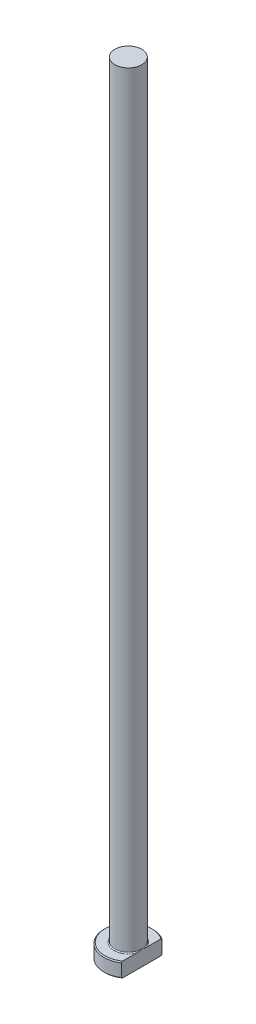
ISO-10303-21;
HEADER;
FILE_DESCRIPTION(('STEP AP214'),'2;1');
FILE_NAME('part.step','',(''),(''),'','','');
FILE_SCHEMA(('AUTOMOTIVE_DESIGN { 1 0 10303 214 1 1 1 1 }'));
ENDSEC;
DATA;
#1=APPLICATION_CONTEXT('core data for automotive mechanical design processes');
#2=APPLICATION_PROTOCOL_DEFINITION('international standard','automotive_design',2000,#1);
#3=PRODUCT_CONTEXT('',#1,'mechanical');
#4=PRODUCT('Part','Part','',(#3));
#5=PRODUCT_RELATED_PRODUCT_CATEGORY('part','',(#4));
#6=PRODUCT_DEFINITION_FORMATION('','',#4);
#7=PRODUCT_DEFINITION_CONTEXT('part definition',#1,'design');
#8=PRODUCT_DEFINITION('design','',#6,#7);
#9=PRODUCT_DEFINITION_SHAPE('','',#8);
#10=(LENGTH_UNIT() NAMED_UNIT(*) SI_UNIT(.MILLI.,.METRE.));
#11=(NAMED_UNIT(*) PLANE_ANGLE_UNIT() SI_UNIT($,.RADIAN.));
#12=(NAMED_UNIT(*) SI_UNIT($,.STERADIAN.) SOLID_ANGLE_UNIT());
#13=UNCERTAINTY_MEASURE_WITH_UNIT(LENGTH_MEASURE(1.E-05),#10,'distance_accuracy_value','');
#14=(GEOMETRIC_REPRESENTATION_CONTEXT(3) GLOBAL_UNCERTAINTY_ASSIGNED_CONTEXT((#13)) GLOBAL_UNIT_ASSIGNED_CONTEXT((#10,
#11,#12)) REPRESENTATION_CONTEXT('',''));
#15=CARTESIAN_POINT('',(0.,0.,0.));
#16=DIRECTION('',(0.,0.,1.));
#17=DIRECTION('',(1.,0.,0.));
#18=AXIS2_PLACEMENT_3D('',#15,#16,#17);
#19=CARTESIAN_POINT('',(0.,0.,0.));
#20=DIRECTION('',(0.,-1.,0.));
#21=DIRECTION('',(0.,0.,-1.));
#22=AXIS2_PLACEMENT_3D('',#19,#20,#21);
#23=PLANE('',#22);
#24=CARTESIAN_POINT('',(0.,0.,0.));
#25=DIRECTION('',(0.,-1.,0.));
#26=DIRECTION('',(0.,0.,-1.));
#27=AXIS2_PLACEMENT_3D('',#24,#25,#26);
#28=CIRCLE('',#27,4.79999999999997);
#29=CARTESIAN_POINT('',(2.74999999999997,0.,3.93414539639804));
#30=VERTEX_POINT('',#29);
#31=CARTESIAN_POINT('',(2.74999999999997,0.,-3.93414539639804));
#32=VERTEX_POINT('',#31);
#33=EDGE_CURVE('E98',#30,#32,#28,.T.);
#34=ORIENTED_EDGE('',*,*,#33,.T.);
#35=DIRECTION('',(0.,0.,1.));
#36=VECTOR('',#35,1.);
#37=CARTESIAN_POINT('',(2.74999999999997,0.,-4.1758232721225));
#38=LINE('',#37,#36);
#39=EDGE_CURVE('E83',#32,#30,#38,.T.);
#40=ORIENTED_EDGE('',*,*,#39,.T.);
#41=EDGE_LOOP('',(#34,#40));
#42=FACE_BOUND('',#41,.T.);
#43=ADVANCED_FACE('F32',(#42),#23,.T.);
#44=CARTESIAN_POINT('',(0.,259.958771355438,0.));
#45=DIRECTION('',(0.,1.,0.));
#46=DIRECTION('',(0.,0.,1.));
#47=AXIS2_PLACEMENT_3D('',#44,#45,#46);
#48=CYLINDRICAL_SURFACE('',#47,4.99999999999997);
#49=CARTESIAN_POINT('',(0.,2.80000000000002,0.));
#50=DIRECTION('',(0.,1.,0.));
#51=DIRECTION('',(0.,0.,1.));
#52=AXIS2_PLACEMENT_3D('',#49,#50,#51);
#53=CIRCLE('',#52,4.99999999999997);
#54=CARTESIAN_POINT('',(2.74999999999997,2.80000000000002,4.1758232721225));
#55=VERTEX_POINT('',#54);
#56=CARTESIAN_POINT('',(2.74999999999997,2.80000000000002,-4.1758232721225));
#57=VERTEX_POINT('',#56);
#58=EDGE_CURVE('E104',#55,#57,#53,.F.);
#59=ORIENTED_EDGE('',*,*,#58,.T.);
#60=DIRECTION('',(0.,-1.,0.));
#61=VECTOR('',#60,1.);
#62=CARTESIAN_POINT('',(2.74999999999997,160.,-4.1758232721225));
#63=LINE('',#62,#61);
#64=CARTESIAN_POINT('',(2.74999999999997,0.199999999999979,-4.1758232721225));
#65=VERTEX_POINT('',#64);
#66=EDGE_CURVE('E183',#57,#65,#63,.T.);
#67=ORIENTED_EDGE('',*,*,#66,.T.);
#68=CARTESIAN_POINT('',(0.,0.199999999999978,0.));
#69=DIRECTION('',(0.,-1.,0.));
#70=DIRECTION('',(0.,0.,-1.));
#71=AXIS2_PLACEMENT_3D('',#68,#69,#70);
#72=CIRCLE('',#71,4.99999999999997);
#73=CARTESIAN_POINT('',(2.74999999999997,0.199999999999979,4.1758232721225));
#74=VERTEX_POINT('',#73);
#75=EDGE_CURVE('E100',#65,#74,#72,.F.);
#76=ORIENTED_EDGE('',*,*,#75,.T.);
#77=DIRECTION('',(0.,-1.,0.));
#78=VECTOR('',#77,1.);
#79=CARTESIAN_POINT('',(2.74999999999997,160.,4.1758232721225));
#80=LINE('',#79,#78);
#81=EDGE_CURVE('E93',#55,#74,#80,.T.);
#82=ORIENTED_EDGE('',*,*,#81,.F.);
#83=EDGE_LOOP('',(#59,#67,#76,#82));
#84=FACE_BOUND('',#83,.T.);
#85=ADVANCED_FACE('F158',(#84),#48,.T.);
#86=CARTESIAN_POINT('',(-4.99999999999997,3.,0.));
#87=DIRECTION('',(0.,1.,0.));
#88=DIRECTION('',(0.,0.,1.));
#89=AXIS2_PLACEMENT_3D('',#86,#87,#88);
#90=PLANE('',#89);
#91=CARTESIAN_POINT('',(0.,3.,0.));
#92=DIRECTION('',(0.,1.,0.));
#93=DIRECTION('',(0.,0.,1.));
#94=AXIS2_PLACEMENT_3D('',#91,#92,#93);
#95=CIRCLE('',#94,4.80000000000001);
#96=CARTESIAN_POINT('',(2.74999999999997,3.,-3.93414539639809));
#97=VERTEX_POINT('',#96);
#98=CARTESIAN_POINT('',(2.74999999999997,3.,3.93414539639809));
#99=VERTEX_POINT('',#98);
#100=EDGE_CURVE('E178',#97,#99,#95,.T.);
#101=ORIENTED_EDGE('',*,*,#100,.T.);
#102=DIRECTION('',(0.,0.,-1.));
#103=VECTOR('',#102,1.);
#104=CARTESIAN_POINT('',(2.74999999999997,3.,0.));
#105=LINE('',#104,#103);
#106=CARTESIAN_POINT('',(2.74999999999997,2.99999999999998,1.06770782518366));
#107=VERTEX_POINT('',#106);
#108=EDGE_CURVE('E57',#99,#107,#105,.T.);
#109=ORIENTED_EDGE('',*,*,#108,.T.);
#110=CARTESIAN_POINT('',(0.,3.,0.));
#111=DIRECTION('',(0.,1.,0.));
#112=DIRECTION('',(0.,0.,1.));
#113=AXIS2_PLACEMENT_3D('',#110,#111,#112);
#114=CIRCLE('',#113,2.94999999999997);
#115=CARTESIAN_POINT('',(2.74999999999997,2.99999999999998,-1.06770782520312));
#116=VERTEX_POINT('',#115);
#117=EDGE_CURVE('E107',#107,#116,#114,.F.);
#118=ORIENTED_EDGE('',*,*,#117,.T.);
#119=EDGE_CURVE('E136',#116,#97,#105,.T.);
#120=ORIENTED_EDGE('',*,*,#119,.T.);
#121=EDGE_LOOP('',(#101,#109,#118,#120));
#122=FACE_BOUND('',#121,.T.);
#123=ADVANCED_FACE('F147',(#122),#90,.T.);
#124=CARTESIAN_POINT('',(0.,3.,0.));
#125=DIRECTION('',(0.,-1.,0.));
#126=DIRECTION('',(0.,0.,-1.));
#127=AXIS2_PLACEMENT_3D('',#124,#125,#126);
#128=CONICAL_SURFACE('',#127,4.80000000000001,0.785398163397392);
#129=ORIENTED_EDGE('',*,*,#58,.F.);
#130=CARTESIAN_POINT('',(2.74999999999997,-1.79114558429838,9.18844783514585));
#131=CARTESIAN_POINT('',(2.74999999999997,-1.62476324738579,9.01476898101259));
#132=CARTESIAN_POINT('',(2.74999999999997,-1.45857819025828,8.84090089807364));
#133=CARTESIAN_POINT('',(2.74999999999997,-1.12668775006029,8.49270511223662));
#134=CARTESIAN_POINT('',(2.74999999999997,-0.960982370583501,8.31837740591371));
#135=CARTESIAN_POINT('',(2.74999999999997,-0.464632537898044,7.79449769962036));
#136=CARTESIAN_POINT('',(2.74999999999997,-0.134839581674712,7.44413786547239));
#137=CARTESIAN_POINT('',(2.74999999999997,0.521406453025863,6.74030951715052));
#138=CARTESIAN_POINT('',(2.74999999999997,0.847859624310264,6.38684108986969));
#139=CARTESIAN_POINT('',(2.74999999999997,1.33353933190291,5.85303151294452));
#140=CARTESIAN_POINT('',(2.74999999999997,1.49475728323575,5.67450358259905));
#141=CARTESIAN_POINT('',(2.74999999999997,1.81545552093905,5.31589537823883));
#142=CARTESIAN_POINT('',(2.74999999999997,1.9749358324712,5.13581512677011));
#143=CARTESIAN_POINT('',(2.74999999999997,2.28246157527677,4.7840971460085));
#144=CARTESIAN_POINT('',(2.74999999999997,2.43063567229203,4.61257212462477));
#145=CARTESIAN_POINT('',(2.74999999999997,2.72427023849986,4.26717959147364));
#146=CARTESIAN_POINT('',(2.74999999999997,2.86973045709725,4.09331186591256));
#147=CARTESIAN_POINT('',(2.74999999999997,3.15716227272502,3.74214491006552));
#148=CARTESIAN_POINT('',(2.74999999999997,3.29912659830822,3.56483970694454));
#149=CARTESIAN_POINT('',(2.74999999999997,3.577639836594,3.20603939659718));
#150=CARTESIAN_POINT('',(2.74999999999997,3.71418980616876,3.02454511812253));
#151=CARTESIAN_POINT('',(2.74999999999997,3.93857405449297,2.71219163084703));
#152=CARTESIAN_POINT('',(2.74999999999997,4.02851673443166,2.58285434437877));
#153=CARTESIAN_POINT('',(2.74999999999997,4.20308451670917,2.32054245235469));
#154=CARTESIAN_POINT('',(2.74999999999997,4.28770764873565,2.18756652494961));
#155=CARTESIAN_POINT('',(2.74999999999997,4.44931959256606,1.91735675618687));
#156=CARTESIAN_POINT('',(2.74999999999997,4.52632375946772,1.78013224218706));
#157=CARTESIAN_POINT('',(2.74999999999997,4.66966790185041,1.50031327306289));
#158=CARTESIAN_POINT('',(2.74999999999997,4.73601725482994,1.35772367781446));
#159=CARTESIAN_POINT('',(2.74999999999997,4.86065113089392,1.04856386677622));
#160=CARTESIAN_POINT('',(2.74999999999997,4.91700799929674,0.881171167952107));
#161=CARTESIAN_POINT('',(2.74999999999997,4.98102802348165,0.625229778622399));
#162=CARTESIAN_POINT('',(2.74999999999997,4.99893817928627,0.539229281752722));
#163=CARTESIAN_POINT('',(2.74999999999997,5.02707157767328,0.365959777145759));
#164=CARTESIAN_POINT('',(2.74999999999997,5.03729562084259,0.278690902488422));
#165=CARTESIAN_POINT('',(2.74999999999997,5.04949232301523,0.102763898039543));
#166=CARTESIAN_POINT('',(2.74999999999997,5.0513883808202,0.0141003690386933));
#167=CARTESIAN_POINT('',(2.74999999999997,5.04659669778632,-0.162990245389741));
#168=CARTESIAN_POINT('',(2.74999999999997,5.03990892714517,-0.251417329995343));
#169=CARTESIAN_POINT('',(2.74999999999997,5.01835539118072,-0.427430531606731));
#170=CARTESIAN_POINT('',(2.74999999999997,5.00347341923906,-0.515014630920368));
#171=CARTESIAN_POINT('',(2.74999999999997,4.96636720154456,-0.688602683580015));
#172=CARTESIAN_POINT('',(2.74999999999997,4.94414138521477,-0.774606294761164));
#173=CARTESIAN_POINT('',(2.74999999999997,4.88037969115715,-0.988315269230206));
#174=CARTESIAN_POINT('',(2.74999999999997,4.83478497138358,-1.1148058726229));
#175=CARTESIAN_POINT('',(2.74999999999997,4.73271903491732,-1.3632998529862));
#176=CARTESIAN_POINT('',(2.74999999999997,4.67623944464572,-1.48529968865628));
#177=CARTESIAN_POINT('',(2.74999999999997,4.554982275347,-1.7258273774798));
#178=CARTESIAN_POINT('',(2.74999999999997,4.49016436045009,-1.84433466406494));
#179=CARTESIAN_POINT('',(2.74999999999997,4.3884903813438,-2.01944141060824));
#180=CARTESIAN_POINT('',(2.74999999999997,4.35386385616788,-2.07735876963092));
#181=CARTESIAN_POINT('',(2.74999999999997,4.28331846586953,-2.19239883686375));
#182=CARTESIAN_POINT('',(2.74999999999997,4.24739965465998,-2.24952157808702));
#183=CARTESIAN_POINT('',(2.74999999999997,4.12488368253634,-2.44019263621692));
#184=CARTESIAN_POINT('',(2.74999999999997,4.03574833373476,-2.57211125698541));
#185=CARTESIAN_POINT('',(2.74999999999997,3.85300432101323,-2.83282496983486));
#186=CARTESIAN_POINT('',(2.74999999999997,3.75939460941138,-2.96161931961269));
#187=CARTESIAN_POINT('',(2.74999999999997,3.56878484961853,-3.21681212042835));
#188=CARTESIAN_POINT('',(2.74999999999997,3.47178237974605,-3.34320875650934));
#189=CARTESIAN_POINT('',(2.74999999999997,3.2752432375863,-3.59402090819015));
#190=CARTESIAN_POINT('',(2.74999999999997,3.17570641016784,-3.71843630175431));
#191=CARTESIAN_POINT('',(2.74999999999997,2.97442282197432,-3.96596722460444));
#192=CARTESIAN_POINT('',(2.74999999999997,2.87267126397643,-4.08907884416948));
#193=CARTESIAN_POINT('',(2.74999999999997,2.66760125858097,-4.3339916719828));
#194=CARTESIAN_POINT('',(2.74999999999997,2.56428277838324,-4.45579285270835));
#195=CARTESIAN_POINT('',(2.74999999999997,2.25255029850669,-4.81947940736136));
#196=CARTESIAN_POINT('',(2.74999999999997,2.04226620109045,-5.05976099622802));
#197=CARTESIAN_POINT('',(2.74999999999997,1.61812846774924,-5.53760543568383));
#198=CARTESIAN_POINT('',(2.74999999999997,1.40427119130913,-5.77516503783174));
#199=CARTESIAN_POINT('',(2.74999999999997,0.974157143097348,-6.24814387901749));
#200=CARTESIAN_POINT('',(2.74999999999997,0.757900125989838,-6.48356289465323));
#201=CARTESIAN_POINT('',(2.74999999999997,0.323911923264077,-6.95249982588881));
#202=CARTESIAN_POINT('',(2.74999999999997,0.106182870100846,-7.18601971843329));
#203=CARTESIAN_POINT('',(2.74999999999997,-0.330587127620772,-7.65182952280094));
#204=CARTESIAN_POINT('',(2.74999999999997,-0.549628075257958,-7.88411943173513));
#205=CARTESIAN_POINT('',(2.74999999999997,-0.854135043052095,-8.20563072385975));
#206=CARTESIAN_POINT('',(2.74999999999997,-0.93916953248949,-8.29526139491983));
#207=CARTESIAN_POINT('',(2.74999999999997,-1.10939110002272,-8.4744044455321));
#208=CARTESIAN_POINT('',(2.74999999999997,-1.19457819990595,-8.56391680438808));
#209=CARTESIAN_POINT('',(2.74999999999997,-1.36493542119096,-8.74266965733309));
#210=CARTESIAN_POINT('',(2.74999999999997,-1.45010532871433,-8.83191035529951));
#211=CARTESIAN_POINT('',(2.74999999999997,-1.62054776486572,-9.01026683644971));
#212=CARTESIAN_POINT('',(2.74999999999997,-1.70582027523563,-9.09938263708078));
#213=CARTESIAN_POINT('',(2.74999999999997,-1.79114558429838,-9.18844783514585));
#214=B_SPLINE_CURVE_WITH_KNOTS('',3,(#130,#131,#132,#133,#134,#135,#136,#137,#138,#139,#140,
#141,#142,#143,#144,#145,#146,#147,#148,#149,#150,#151,#152,#153,#154,#155,#156,#157,#158,#159,
#160,#161,#162,#163,#164,#165,#166,#167,#168,#169,#170,#171,#172,#173,#174,#175,#176,#177,#178,
#179,#180,#181,#182,#183,#184,#185,#186,#187,#188,#189,#190,#191,#192,#193,#194,#195,#196,#197,
#198,#199,#200,#201,#202,#203,#204,#205,#206,#207,#208,#209,#210,#211,#212,#213),.UNSPECIFIED.,
.F.,.F.,(4,2,2,2,2,2,2,2,2,2,2,2,2,2,2,2,2,2,2,2,2,2,2,2,2,2,2,2,2,2,2,2,2,2,2,2,2,2,2,2,2,4),
(0.,0.72154477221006,1.44309493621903,2.88656432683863,4.32999349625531,5.05163004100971,
5.77325612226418,6.45322671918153,7.13325979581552,7.81460476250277,8.49581607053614,
8.96833065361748,9.44101923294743,9.91273488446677,10.3840330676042,10.9119743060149,
11.1752192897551,11.4384368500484,11.7040704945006,11.969705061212,12.2358669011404,
12.5020857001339,12.9047274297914,13.3076801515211,13.7126610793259,13.9150857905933,
14.1175020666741,14.5949844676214,15.0725792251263,15.5505221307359,16.0284943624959,
16.5076321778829,16.9867800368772,17.9446362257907,18.9035363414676,19.8625354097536,
20.8203587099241,21.7781842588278,22.1488332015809,22.5195401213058,22.8896215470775,
23.2596447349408),.UNSPECIFIED.);
#215=EDGE_CURVE('E135',#55,#99,#214,.T.);
#216=ORIENTED_EDGE('',*,*,#215,.T.);
#217=ORIENTED_EDGE('',*,*,#100,.F.);
#218=EDGE_CURVE('E127',#97,#57,#214,.T.);
#219=ORIENTED_EDGE('',*,*,#218,.T.);
#220=EDGE_LOOP('',(#129,#216,#217,#219));
#221=FACE_BOUND('',#220,.T.);
#222=ADVANCED_FACE('F143',(#221),#128,.T.);
#223=CARTESIAN_POINT('',(0.,0.199999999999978,0.));
#224=DIRECTION('',(0.,1.,0.));
#225=DIRECTION('',(0.,0.,1.));
#226=AXIS2_PLACEMENT_3D('',#223,#224,#225);
#227=CONICAL_SURFACE('',#226,4.99999999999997,0.785398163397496);
#228=ORIENTED_EDGE('',*,*,#75,.F.);
#229=CARTESIAN_POINT('',(2.74999999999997,4.79114558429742,-9.18844783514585));
#230=CARTESIAN_POINT('',(2.74999999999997,4.62476324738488,-9.0147689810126));
#231=CARTESIAN_POINT('',(2.74999999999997,4.45857819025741,-8.84090089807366));
#232=CARTESIAN_POINT('',(2.74999999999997,4.12668775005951,-8.49270511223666));
#233=CARTESIAN_POINT('',(2.74999999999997,3.96098237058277,-8.31837740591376));
#234=CARTESIAN_POINT('',(2.74999999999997,3.46463253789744,-7.79449769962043));
#235=CARTESIAN_POINT('',(2.74999999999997,3.13483958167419,-7.44413786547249));
#236=CARTESIAN_POINT('',(2.74999999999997,2.47859354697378,-6.74030951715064));
#237=CARTESIAN_POINT('',(2.74999999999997,2.15214037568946,-6.38684108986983));
#238=CARTESIAN_POINT('',(2.74999999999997,1.66646066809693,-5.85303151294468));
#239=CARTESIAN_POINT('',(2.74999999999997,1.50524271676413,-5.67450358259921));
#240=CARTESIAN_POINT('',(2.74999999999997,1.1845444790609,-5.31589537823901));
#241=CARTESIAN_POINT('',(2.74999999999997,1.02506416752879,-5.13581512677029));
#242=CARTESIAN_POINT('',(2.74999999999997,0.717538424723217,-4.78409714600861));
#243=CARTESIAN_POINT('',(2.74999999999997,0.569364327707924,-4.6125721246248));
#244=CARTESIAN_POINT('',(2.74999999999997,0.275729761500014,-4.26717959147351));
#245=CARTESIAN_POINT('',(2.74999999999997,0.130269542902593,-4.09331186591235));
#246=CARTESIAN_POINT('',(2.74999999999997,-0.157162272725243,-3.74214491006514));
#247=CARTESIAN_POINT('',(2.74999999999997,-0.299126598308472,-3.56483970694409));
#248=CARTESIAN_POINT('',(2.74999999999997,-0.577639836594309,-3.20603939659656));
#249=CARTESIAN_POINT('',(2.74999999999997,-0.714189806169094,-3.02454511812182));
#250=CARTESIAN_POINT('',(2.74999999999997,-0.938574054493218,-2.71219163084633));
#251=CARTESIAN_POINT('',(2.74999999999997,-1.02851673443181,-2.58285434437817));
#252=CARTESIAN_POINT('',(2.74999999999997,-1.20308451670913,-2.3205424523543));
#253=CARTESIAN_POINT('',(2.74999999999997,-1.28770764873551,-2.18756652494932));
#254=CARTESIAN_POINT('',(2.74999999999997,-1.44931959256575,-1.91735675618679));
#255=CARTESIAN_POINT('',(2.74999999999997,-1.52632375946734,-1.7801322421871));
#256=CARTESIAN_POINT('',(2.74999999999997,-1.66966790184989,-1.50031327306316));
#257=CARTESIAN_POINT('',(2.74999999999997,-1.73601725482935,-1.35772367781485));
#258=CARTESIAN_POINT('',(2.74999999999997,-1.86065113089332,-1.04856386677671));
#259=CARTESIAN_POINT('',(2.74999999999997,-1.91700799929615,-0.881171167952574));
#260=CARTESIAN_POINT('',(2.74999999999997,-1.9810280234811,-0.625229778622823));
#261=CARTESIAN_POINT('',(2.74999999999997,-1.99893817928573,-0.539229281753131));
#262=CARTESIAN_POINT('',(2.74999999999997,-2.02707157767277,-0.365959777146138));
#263=CARTESIAN_POINT('',(2.74999999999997,-2.03729562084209,-0.278690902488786));
#264=CARTESIAN_POINT('',(2.74999999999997,-2.04949232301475,-0.102763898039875));
#265=CARTESIAN_POINT('',(2.74999999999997,-2.05138838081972,-0.0141003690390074));
#266=CARTESIAN_POINT('',(2.74999999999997,-2.04659669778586,0.162990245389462));
#267=CARTESIAN_POINT('',(2.74999999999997,-2.03990892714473,0.251417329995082));
#268=CARTESIAN_POINT('',(2.74999999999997,-2.01835539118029,0.427430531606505));
#269=CARTESIAN_POINT('',(2.74999999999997,-2.00347341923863,0.515014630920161));
#270=CARTESIAN_POINT('',(2.74999999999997,-1.96636720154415,0.688602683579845));
#271=CARTESIAN_POINT('',(2.74999999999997,-1.94414138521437,0.774606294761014));
#272=CARTESIAN_POINT('',(2.74999999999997,-1.88037969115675,0.988315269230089));
#273=CARTESIAN_POINT('',(2.74999999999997,-1.83478497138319,1.1148058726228));
#274=CARTESIAN_POINT('',(2.74999999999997,-1.73271903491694,1.36329985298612));
#275=CARTESIAN_POINT('',(2.74999999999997,-1.67623944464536,1.48529968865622));
#276=CARTESIAN_POINT('',(2.74999999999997,-1.55498227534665,1.72582737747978));
#277=CARTESIAN_POINT('',(2.74999999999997,-1.49016436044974,1.84433466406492));
#278=CARTESIAN_POINT('',(2.74999999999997,-1.38849038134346,2.01944141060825));
#279=CARTESIAN_POINT('',(2.74999999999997,-1.35386385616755,2.07735876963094));
#280=CARTESIAN_POINT('',(2.74999999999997,-1.2833184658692,2.19239883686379));
#281=CARTESIAN_POINT('',(2.74999999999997,-1.24739965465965,2.24952157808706));
#282=CARTESIAN_POINT('',(2.74999999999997,-1.12488368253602,2.44019263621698));
#283=CARTESIAN_POINT('',(2.74999999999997,-1.03574833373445,2.57211125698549));
#284=CARTESIAN_POINT('',(2.74999999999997,-0.853004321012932,2.83282496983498));
#285=CARTESIAN_POINT('',(2.74999999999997,-0.759394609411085,2.96161931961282));
#286=CARTESIAN_POINT('',(2.74999999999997,-0.568784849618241,3.21681212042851));
#287=CARTESIAN_POINT('',(2.74999999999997,-0.471782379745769,3.34320875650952));
#288=CARTESIAN_POINT('',(2.74999999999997,-0.275243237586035,3.59402090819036));
#289=CARTESIAN_POINT('',(2.74999999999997,-0.175706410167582,3.71843630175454));
#290=CARTESIAN_POINT('',(2.74999999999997,0.0255771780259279,3.96596722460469));
#291=CARTESIAN_POINT('',(2.74999999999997,0.127328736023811,4.08907884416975));
#292=CARTESIAN_POINT('',(2.74999999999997,0.33239874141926,4.3339916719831));
#293=CARTESIAN_POINT('',(2.74999999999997,0.435717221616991,4.45579285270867));
#294=CARTESIAN_POINT('',(2.74999999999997,0.747449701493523,4.81947940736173));
#295=CARTESIAN_POINT('',(2.74999999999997,0.957733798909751,5.05976099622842));
#296=CARTESIAN_POINT('',(2.74999999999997,1.38187153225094,5.53760543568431));
#297=CARTESIAN_POINT('',(2.74999999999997,1.59572880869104,5.77516503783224));
#298=CARTESIAN_POINT('',(2.74999999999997,2.0258428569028,6.24814387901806));
#299=CARTESIAN_POINT('',(2.74999999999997,2.2420998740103,6.48356289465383));
#300=CARTESIAN_POINT('',(2.74999999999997,2.67608807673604,6.95249982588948));
#301=CARTESIAN_POINT('',(2.74999999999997,2.89381712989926,7.186019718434));
#302=CARTESIAN_POINT('',(2.74999999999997,3.33058712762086,7.65182952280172));
#303=CARTESIAN_POINT('',(2.74999999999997,3.54962807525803,7.88411943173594));
#304=CARTESIAN_POINT('',(2.74999999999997,3.85413504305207,8.20563072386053));
#305=CARTESIAN_POINT('',(2.74999999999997,3.93916953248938,8.29526139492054));
#306=CARTESIAN_POINT('',(2.74999999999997,4.10939110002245,8.47440444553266));
#307=CARTESIAN_POINT('',(2.74999999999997,4.19457819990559,8.56391680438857));
#308=CARTESIAN_POINT('',(2.74999999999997,4.36493542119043,8.74266965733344));
#309=CARTESIAN_POINT('',(2.74999999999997,4.45010532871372,8.83191035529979));
#310=CARTESIAN_POINT('',(2.74999999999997,4.62054776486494,9.01026683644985));
#311=CARTESIAN_POINT('',(2.74999999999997,4.70582027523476,9.09938263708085));
#312=CARTESIAN_POINT('',(2.74999999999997,4.79114558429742,9.18844783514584));
#313=B_SPLINE_CURVE_WITH_KNOTS('',3,(#229,#230,#231,#232,#233,#234,#235,#236,#237,#238,#239,
#240,#241,#242,#243,#244,#245,#246,#247,#248,#249,#250,#251,#252,#253,#254,#255,#256,#257,#258,
#259,#260,#261,#262,#263,#264,#265,#266,#267,#268,#269,#270,#271,#272,#273,#274,#275,#276,#277,
#278,#279,#280,#281,#282,#283,#284,#285,#286,#287,#288,#289,#290,#291,#292,#293,#294,#295,#296,
#297,#298,#299,#300,#301,#302,#303,#304,#305,#306,#307,#308,#309,#310,#311,#312),.UNSPECIFIED.,
.F.,.F.,(4,2,2,2,2,2,2,2,2,2,2,2,2,2,2,2,2,2,2,2,2,2,2,2,2,2,2,2,2,2,2,2,2,2,2,2,2,2,2,2,2,4),
(0.,0.721544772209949,1.4430949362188,2.88656432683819,4.32999349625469,5.05163004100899,
5.77325612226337,6.45322671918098,7.13325979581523,7.81460476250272,8.49581607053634,
8.96833065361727,9.4410192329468,9.91273488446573,10.3840330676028,10.9119743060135,
11.1752192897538,11.4384368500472,11.7040704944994,11.9697050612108,12.2358669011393,
12.5020857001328,12.9047274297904,13.3076801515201,13.712661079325,13.9150857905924,
14.1175020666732,14.5949844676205,15.0725792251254,15.5505221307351,16.0284943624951,
16.5076321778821,16.9867800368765,17.94463622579,18.9035363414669,19.862535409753,
20.8203587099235,21.7781842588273,22.1488332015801,22.5195401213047,22.889621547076,
23.259644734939),.UNSPECIFIED.);
#314=EDGE_CURVE('E86',#65,#32,#313,.T.);
#315=ORIENTED_EDGE('',*,*,#314,.T.);
#316=ORIENTED_EDGE('',*,*,#33,.F.);
#317=EDGE_CURVE('E89',#30,#74,#313,.T.);
#318=ORIENTED_EDGE('',*,*,#317,.T.);
#319=EDGE_LOOP('',(#228,#315,#316,#318));
#320=FACE_BOUND('',#319,.T.);
#321=ADVANCED_FACE('F97',(#320),#227,.T.);
#322=CARTESIAN_POINT('',(0.,3.19999999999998,0.));
#323=DIRECTION('',(0.,1.,0.));
#324=DIRECTION('',(0.,0.,1.));
#325=AXIS2_PLACEMENT_3D('',#322,#323,#324);
#326=TOROIDAL_SURFACE('',#325,2.94999999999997,0.2);
#327=CARTESIAN_POINT('',(2.74999999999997,3.19999999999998,0.));
#328=CARTESIAN_POINT('',(2.74999999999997,3.20000050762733,1.12997179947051E-10));
#329=CARTESIAN_POINT('',(2.74999999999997,3.20000101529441,-1.81527532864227E-07));
#330=CARTESIAN_POINT('',(2.74999999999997,3.20000196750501,-6.94840309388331E-07));
#331=CARTESIAN_POINT('',(2.74999999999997,3.20000240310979,-1.03787717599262E-06));
#332=CARTESIAN_POINT('',(2.74999999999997,3.20000330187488,-1.85808127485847E-06));
#333=CARTESIAN_POINT('',(2.74999999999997,3.20000375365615,-2.34835981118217E-06));
#334=CARTESIAN_POINT('',(2.74999999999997,3.20000456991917,-3.3704695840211E-06));
#335=CARTESIAN_POINT('',(2.74999999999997,3.20000493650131,-3.90074158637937E-06));
#336=CARTESIAN_POINT('',(2.74999999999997,3.20000627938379,-5.9326172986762E-06));
#337=CARTESIAN_POINT('',(2.74999999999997,3.20000718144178,-7.48563172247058E-06));
#338=CARTESIAN_POINT('',(2.74999999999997,3.20000868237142,-1.0579008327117E-05));
#339=CARTESIAN_POINT('',(2.74999999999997,3.20000929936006,-1.21109700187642E-05));
#340=CARTESIAN_POINT('',(2.74999999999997,3.2000118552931,-1.85322192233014E-05));
#341=CARTESIAN_POINT('',(2.74999999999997,3.20001373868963,-2.34472711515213E-05));
#342=CARTESIAN_POINT('',(2.74999999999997,3.20001654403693,-3.27779451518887E-05));
#343=CARTESIAN_POINT('',(2.74999999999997,3.20001756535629,-3.71636222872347E-05));
#344=CARTESIAN_POINT('',(2.74999999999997,3.20002495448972,-6.95743732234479E-05));
#345=CARTESIAN_POINT('',(2.74999999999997,3.20003050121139,-9.77394523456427E-05));
#346=CARTESIAN_POINT('',(2.74999999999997,3.20005478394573,-0.000208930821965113));
#347=CARTESIAN_POINT('',(2.74999999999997,3.2000780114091,-0.000290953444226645));
#348=CARTESIAN_POINT('',(2.74999999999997,3.20016837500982,-0.000615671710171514));
#349=CARTESIAN_POINT('',(2.74999999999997,3.20023256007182,-0.0008589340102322));
#350=CARTESIAN_POINT('',(2.74999999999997,3.20048946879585,-0.00182516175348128));
#351=CARTESIAN_POINT('',(2.74999999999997,3.20068588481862,-0.00254739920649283));
#352=CARTESIAN_POINT('',(2.74999999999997,3.20150145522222,-0.0055546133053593));
#353=CARTESIAN_POINT('',(2.74999999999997,3.20211597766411,-0.00784050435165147));
#354=CARTESIAN_POINT('',(2.74999999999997,3.20754641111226,-0.0280301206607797));
#355=CARTESIAN_POINT('',(2.74999999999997,3.2123805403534,-0.0459303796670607));
#356=CARTESIAN_POINT('',(2.74999999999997,3.22182435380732,-0.081029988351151));
#357=CARTESIAN_POINT('',(2.74999999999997,3.226435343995,-0.0982290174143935));
#358=CARTESIAN_POINT('',(2.74999999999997,3.23620184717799,-0.134808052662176));
#359=CARTESIAN_POINT('',(2.74999999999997,3.24135263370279,-0.154189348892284));
#360=CARTESIAN_POINT('',(2.74999999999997,3.25163624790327,-0.193181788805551));
#361=CARTESIAN_POINT('',(2.74999999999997,3.25676827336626,-0.21279314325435));
#362=CARTESIAN_POINT('',(2.74999999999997,3.26905119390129,-0.260223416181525));
#363=CARTESIAN_POINT('',(2.74999999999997,3.27615177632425,-0.288055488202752));
#364=CARTESIAN_POINT('',(2.74999999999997,3.28988618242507,-0.343037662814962));
#365=CARTESIAN_POINT('',(2.74999999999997,3.29652742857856,-0.370185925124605));
#366=CARTESIAN_POINT('',(2.74999999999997,3.3179119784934,-0.460013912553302));
#367=CARTESIAN_POINT('',(2.74999999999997,3.33192996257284,-0.522872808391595));
#368=CARTESIAN_POINT('',(2.74999999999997,3.35724782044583,-0.649858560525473));
#369=CARTESIAN_POINT('',(2.74999999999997,3.36851625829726,-0.713991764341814));
#370=CARTESIAN_POINT('',(2.74999999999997,3.38744836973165,-0.848144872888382));
#371=CARTESIAN_POINT('',(2.74999999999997,3.39474814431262,-0.918222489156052));
#372=CARTESIAN_POINT('',(2.74999999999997,3.39971832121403,-1.02344881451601));
#373=CARTESIAN_POINT('',(2.74999999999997,3.40038441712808,-1.05845158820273));
#374=CARTESIAN_POINT('',(2.74999999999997,3.39917295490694,-1.12840448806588));
#375=CARTESIAN_POINT('',(2.74999999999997,3.39729798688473,-1.16335463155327));
#376=CARTESIAN_POINT('',(2.74999999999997,3.39199994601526,-1.21505383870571));
#377=CARTESIAN_POINT('',(2.74999999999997,3.38986571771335,-1.23193598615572));
#378=CARTESIAN_POINT('',(2.74999999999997,3.38464996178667,-1.26557152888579));
#379=CARTESIAN_POINT('',(2.74999999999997,3.38156766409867,-1.28232480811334));
#380=CARTESIAN_POINT('',(2.74999999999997,3.37431364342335,-1.31540767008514));
#381=CARTESIAN_POINT('',(2.74999999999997,3.37015411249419,-1.33173987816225));
#382=CARTESIAN_POINT('',(2.74999999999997,3.36048976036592,-1.36399299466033));
#383=CARTESIAN_POINT('',(2.74999999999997,3.35498646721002,-1.37991434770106));
#384=CARTESIAN_POINT('',(2.74999999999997,3.34222746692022,-1.41123903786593));
#385=CARTESIAN_POINT('',(2.74999999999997,3.33495457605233,-1.42663549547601));
#386=CARTESIAN_POINT('',(2.74999999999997,3.318175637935,-1.45617471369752));
#387=CARTESIAN_POINT('',(2.74999999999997,3.30867792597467,-1.4703218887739));
#388=CARTESIAN_POINT('',(2.74999999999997,3.29277007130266,-1.48907990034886));
#389=CARTESIAN_POINT('',(2.74999999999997,3.2875192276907,-1.49466894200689));
#390=CARTESIAN_POINT('',(2.74999999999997,3.27634440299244,-1.50515028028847));
#391=CARTESIAN_POINT('',(2.74999999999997,3.27042002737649,-1.51004216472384));
#392=CARTESIAN_POINT('',(2.74999999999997,3.25778482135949,-1.51891099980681));
#393=CARTESIAN_POINT('',(2.74999999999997,3.2510643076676,-1.52287446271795));
#394=CARTESIAN_POINT('',(2.74999999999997,3.23698143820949,-1.5294174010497));
#395=CARTESIAN_POINT('',(2.74999999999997,3.22962116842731,-1.53200119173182));
#396=CARTESIAN_POINT('',(2.74999999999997,3.2166326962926,-1.53496289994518));
#397=CARTESIAN_POINT('',(2.74999999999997,3.2110985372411,-1.53575651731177));
#398=CARTESIAN_POINT('',(2.74999999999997,3.19997558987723,-1.53638738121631));
#399=CARTESIAN_POINT('',(2.74999999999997,3.19438682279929,-1.53622498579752));
#400=CARTESIAN_POINT('',(2.74999999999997,3.18332943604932,-1.53495937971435));
#401=CARTESIAN_POINT('',(2.74999999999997,3.17786061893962,-1.53385785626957));
#402=CARTESIAN_POINT('',(2.74999999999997,3.16716525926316,-1.53080991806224));
#403=CARTESIAN_POINT('',(2.74999999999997,3.16193889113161,-1.52886290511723));
#404=CARTESIAN_POINT('',(2.74999999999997,3.14983366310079,-1.52335528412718));
#405=CARTESIAN_POINT('',(2.74999999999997,3.14310699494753,-1.51946144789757));
#406=CARTESIAN_POINT('',(2.74999999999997,3.13035821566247,-1.51065443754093));
#407=CARTESIAN_POINT('',(2.74999999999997,3.12433789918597,-1.50573875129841));
#408=CARTESIAN_POINT('',(2.74999999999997,3.10956608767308,-1.4920109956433));
#409=CARTESIAN_POINT('',(2.74999999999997,3.10134587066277,-1.48263193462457));
#410=CARTESIAN_POINT('',(2.74999999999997,3.08638427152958,-1.46278796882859));
#411=CARTESIAN_POINT('',(2.74999999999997,3.07964511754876,-1.45232146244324));
#412=CARTESIAN_POINT('',(2.74999999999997,3.06171675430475,-1.42080727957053));
#413=CARTESIAN_POINT('',(2.74999999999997,3.05211924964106,-1.39886385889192));
#414=CARTESIAN_POINT('',(2.74999999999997,3.03592584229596,-1.35377597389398));
#415=CARTESIAN_POINT('',(2.74999999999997,3.02935693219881,-1.33062268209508));
#416=CARTESIAN_POINT('',(2.74999999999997,3.01641276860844,-1.27469229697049));
#417=CARTESIAN_POINT('',(2.74999999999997,3.01110503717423,-1.24167224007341));
#418=CARTESIAN_POINT('',(2.74999999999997,3.00364182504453,-1.17522319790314));
#419=CARTESIAN_POINT('',(2.74999999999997,3.00149608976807,-1.14179326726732));
#420=CARTESIAN_POINT('',(2.74999999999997,2.99965905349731,-1.0761846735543));
#421=CARTESIAN_POINT('',(2.74999999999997,2.9998750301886,-1.04400821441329));
#422=CARTESIAN_POINT('',(2.74999999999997,3.00208041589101,-0.979705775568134));
#423=CARTESIAN_POINT('',(2.74999999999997,3.00407086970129,-0.94757983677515));
#424=CARTESIAN_POINT('',(2.74999999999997,3.01231998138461,-0.849711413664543));
#425=CARTESIAN_POINT('',(2.74999999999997,3.02086596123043,-0.784164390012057));
#426=CARTESIAN_POINT('',(2.74999999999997,3.04217753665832,-0.652153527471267));
#427=CARTESIAN_POINT('',(2.74999999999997,3.05504187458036,-0.585706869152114));
#428=CARTESIAN_POINT('',(2.74999999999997,3.07899589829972,-0.474257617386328));
#429=CARTESIAN_POINT('',(2.74999999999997,3.08936705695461,-0.429096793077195));
#430=CARTESIAN_POINT('',(2.74999999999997,3.11088695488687,-0.339494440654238));
#431=CARTESIAN_POINT('',(2.74999999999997,3.12202574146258,-0.295050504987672));
#432=CARTESIAN_POINT('',(2.74999999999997,3.14355229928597,-0.211341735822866));
#433=CARTESIAN_POINT('',(2.74999999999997,3.15388178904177,-0.17206169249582));
#434=CARTESIAN_POINT('',(2.74999999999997,3.17523671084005,-0.0918970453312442));
#435=CARTESIAN_POINT('',(2.74999999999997,3.18627305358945,-0.0510152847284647));
#436=CARTESIAN_POINT('',(2.74999999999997,3.19788514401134,-0.00783595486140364));
#437=CARTESIAN_POINT('',(2.74999999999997,3.19850096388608,-0.00554554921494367));
#438=CARTESIAN_POINT('',(2.74999999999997,3.19931683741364,-0.00253730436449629));
#439=CARTESIAN_POINT('',(2.74999999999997,3.19951229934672,-0.00181855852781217));
#440=CARTESIAN_POINT('',(2.74999999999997,3.19976804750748,-0.000856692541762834));
#441=CARTESIAN_POINT('',(2.74999999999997,3.19983200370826,-0.000614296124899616));
#442=CARTESIAN_POINT('',(2.74999999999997,3.19992209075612,-0.000290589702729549));
#443=CARTESIAN_POINT('',(2.74999999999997,3.19994527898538,-0.000208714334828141));
#444=CARTESIAN_POINT('',(2.74999999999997,3.19996952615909,-9.76928428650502E-05));
#445=CARTESIAN_POINT('',(2.74999999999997,3.19997506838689,-6.95486157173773E-05));
#446=CARTESIAN_POINT('',(2.74999999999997,3.19998244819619,-3.71590915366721E-05));
#447=CARTESIAN_POINT('',(2.74999999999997,3.1999834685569,-3.2774592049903E-05));
#448=CARTESIAN_POINT('',(2.74999999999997,3.19998627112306,-2.34463157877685E-05));
#449=CARTESIAN_POINT('',(2.74999999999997,3.19998815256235,-1.85324214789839E-05));
#450=CARTESIAN_POINT('',(2.74999999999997,3.19999070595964,-1.21123670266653E-05));
#451=CARTESIAN_POINT('',(2.74999999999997,3.19999132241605,-1.05804935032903E-05));
#452=CARTESIAN_POINT('',(2.74999999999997,3.1999928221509,-7.4872040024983E-06));
#453=CARTESIAN_POINT('',(2.74999999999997,3.19999372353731,-5.93417784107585E-06));
#454=CARTESIAN_POINT('',(2.74999999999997,3.19999506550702,-3.90218205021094E-06));
#455=CARTESIAN_POINT('',(2.74999999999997,3.19999543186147,-3.37184999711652E-06));
#456=CARTESIAN_POINT('',(2.74999999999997,3.19999624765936,-2.3495790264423E-06));
#457=CARTESIAN_POINT('',(2.74999999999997,3.1999966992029,-1.85919798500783E-06));
#458=CARTESIAN_POINT('',(2.74999999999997,3.19999759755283,-1.03875218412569E-06));
#459=CARTESIAN_POINT('',(2.74999999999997,3.19999803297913,-6.95584891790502E-07));
#460=CARTESIAN_POINT('',(2.74999999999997,3.19999898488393,-1.81944076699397E-07));
#461=CARTESIAN_POINT('',(2.74999999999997,3.1999994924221,-1.12986168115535E-10));
#462=CARTESIAN_POINT('',(2.74999999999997,3.19999999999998,0.));
#463=B_SPLINE_CURVE_WITH_KNOTS('',3,(#327,#328,#329,#330,#331,#332,#333,#334,#335,#336,#337,
#338,#339,#340,#341,#342,#343,#344,#345,#346,#347,#348,#349,#350,#351,#352,#353,#354,#355,#356,
#357,#358,#359,#360,#361,#362,#363,#364,#365,#366,#367,#368,#369,#370,#371,#372,#373,#374,#375,
#376,#377,#378,#379,#380,#381,#382,#383,#384,#385,#386,#387,#388,#389,#390,#391,#392,#393,#394,
#395,#396,#397,#398,#399,#400,#401,#402,#403,#404,#405,#406,#407,#408,#409,#410,#411,#412,#413,
#414,#415,#416,#417,#418,#419,#420,#421,#422,#423,#424,#425,#426,#427,#428,#429,#430,#431,#432,
#433,#434,#435,#436,#437,#438,#439,#440,#441,#442,#443,#444,#445,#446,#447,#448,#449,#450,#451,
#452,#453,#454,#455,#456,#457,#458,#459,#460,#461,#462),.UNSPECIFIED.,.T.,.F.,(4,2,2,2,2,2,2,2,
2,2,2,2,2,2,2,2,2,2,2,2,2,2,2,2,2,2,2,2,2,2,2,2,2,2,2,2,2,2,2,2,2,2,2,2,2,2,2,2,2,2,2,2,2,2,2,2,
2,2,2,2,2,2,2,2,2,2,2,4),(0.,1.53302763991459E-06,3.19538931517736E-06,5.18410400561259E-06,
7.11680710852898E-06,1.24843266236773E-05,1.74346122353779E-05,3.3195428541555E-05,
4.66876455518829E-05,0.000132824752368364,0.000388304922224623,0.00114333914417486,
0.0033884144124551,0.0104899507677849,0.0661127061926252,0.119532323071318,0.179694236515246,
0.240509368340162,0.326678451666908,0.410524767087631,0.603684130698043,0.798958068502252,
1.00997653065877,1.11494231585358,1.21980118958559,1.27083021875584,1.32190080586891,
1.37241688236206,1.42287578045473,1.4738457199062,1.52462767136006,1.54758745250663,
1.57056075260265,1.59384955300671,1.61706507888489,1.6337610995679,1.65045086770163,
1.66711071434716,1.68378236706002,1.70696786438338,1.73021104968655,1.76741395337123,
1.80467244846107,1.87612299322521,1.94819858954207,2.0482867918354,2.14868283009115,
2.24515187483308,2.34167775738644,2.53976637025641,2.74273377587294,2.88173187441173,
3.01918106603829,3.14102752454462,3.268058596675,3.27517420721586,3.27740842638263,
3.27816077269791,3.27841579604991,3.27850186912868,3.27851535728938,3.27853111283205,
3.27853606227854,3.27854142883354,3.27854336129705,3.27854534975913,3.27854701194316,
3.2785485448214),.UNSPECIFIED.);
#464=CARTESIAN_POINT('',(2.74999999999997,3.19999999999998,0.));
#465=VERTEX_POINT('',#464);
#466=EDGE_CURVE('E11',#116,#465,#463,.T.);
#467=ORIENTED_EDGE('',*,*,#466,.F.);
#468=ORIENTED_EDGE('',*,*,#117,.F.);
#469=CARTESIAN_POINT('',(2.74999999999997,3.19999999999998,0.));
#470=CARTESIAN_POINT('',(2.74999999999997,3.19999949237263,-1.12997235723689E-10));
#471=CARTESIAN_POINT('',(2.74999999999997,3.19999898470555,1.8152753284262E-07));
#472=CARTESIAN_POINT('',(2.74999999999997,3.19999803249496,6.94840309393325E-07));
#473=CARTESIAN_POINT('',(2.74999999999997,3.19999759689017,1.03787717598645E-06));
#474=CARTESIAN_POINT('',(2.74999999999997,3.19999669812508,1.85808127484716E-06));
#475=CARTESIAN_POINT('',(2.74999999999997,3.19999624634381,2.34835981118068E-06));
#476=CARTESIAN_POINT('',(2.74999999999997,3.19999543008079,3.37046958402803E-06));
#477=CARTESIAN_POINT('',(2.74999999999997,3.19999506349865,3.90074158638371E-06));
#478=CARTESIAN_POINT('',(2.74999999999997,3.19999372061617,5.93261729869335E-06));
#479=CARTESIAN_POINT('',(2.74999999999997,3.19999281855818,7.48563172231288E-06));
#480=CARTESIAN_POINT('',(2.74999999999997,3.19999131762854,1.05790083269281E-05));
#481=CARTESIAN_POINT('',(2.74999999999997,3.1999907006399,1.21109700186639E-05));
#482=CARTESIAN_POINT('',(2.74999999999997,3.19998814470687,1.85322192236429E-05));
#483=CARTESIAN_POINT('',(2.74999999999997,3.19998626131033,2.34472711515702E-05));
#484=CARTESIAN_POINT('',(2.74999999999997,3.19998345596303,3.27779451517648E-05));
#485=CARTESIAN_POINT('',(2.74999999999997,3.19998243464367,3.71636222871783E-05));
#486=CARTESIAN_POINT('',(2.74999999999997,3.19997504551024,6.95743732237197E-05));
#487=CARTESIAN_POINT('',(2.74999999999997,3.19996949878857,9.77394523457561E-05));
#488=CARTESIAN_POINT('',(2.74999999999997,3.19994521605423,0.000208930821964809));
#489=CARTESIAN_POINT('',(2.74999999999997,3.19992198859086,0.000290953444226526));
#490=CARTESIAN_POINT('',(2.74999999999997,3.19983162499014,0.000615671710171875));
#491=CARTESIAN_POINT('',(2.74999999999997,3.19976743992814,0.000858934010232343));
#492=CARTESIAN_POINT('',(2.74999999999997,3.19951053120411,0.00182516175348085));
#493=CARTESIAN_POINT('',(2.74999999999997,3.19931411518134,0.00254739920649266));
#494=CARTESIAN_POINT('',(2.74999999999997,3.19849854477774,0.00555461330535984));
#495=CARTESIAN_POINT('',(2.74999999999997,3.19788402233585,0.00784050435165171));
#496=CARTESIAN_POINT('',(2.74999999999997,3.1924535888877,0.0280301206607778));
#497=CARTESIAN_POINT('',(2.74999999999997,3.18761945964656,0.0459303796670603));
#498=CARTESIAN_POINT('',(2.74999999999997,3.17817564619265,0.0810299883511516));
#499=CARTESIAN_POINT('',(2.74999999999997,3.17356465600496,0.0982290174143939));
#500=CARTESIAN_POINT('',(2.74999999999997,3.16379815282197,0.134808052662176));
#501=CARTESIAN_POINT('',(2.74999999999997,3.15864736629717,0.154189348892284));
#502=CARTESIAN_POINT('',(2.74999999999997,3.14836375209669,0.193181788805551));
#503=CARTESIAN_POINT('',(2.74999999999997,3.1432317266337,0.21279314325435));
#504=CARTESIAN_POINT('',(2.74999999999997,3.13094880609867,0.260223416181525));
#505=CARTESIAN_POINT('',(2.74999999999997,3.12384822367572,0.288055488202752));
#506=CARTESIAN_POINT('',(2.74999999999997,3.1101138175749,0.343037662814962));
#507=CARTESIAN_POINT('',(2.74999999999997,3.1034725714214,0.370185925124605));
#508=CARTESIAN_POINT('',(2.74999999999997,3.08208802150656,0.460013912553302));
#509=CARTESIAN_POINT('',(2.74999999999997,3.06807003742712,0.522872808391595));
#510=CARTESIAN_POINT('',(2.74999999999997,3.04275217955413,0.649858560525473));
#511=CARTESIAN_POINT('',(2.74999999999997,3.03148374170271,0.713991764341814));
#512=CARTESIAN_POINT('',(2.74999999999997,3.01255163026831,0.848144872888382));
#513=CARTESIAN_POINT('',(2.74999999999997,3.00525185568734,0.918222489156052));
#514=CARTESIAN_POINT('',(2.74999999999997,3.00028167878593,1.02344881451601));
#515=CARTESIAN_POINT('',(2.74999999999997,2.99961558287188,1.05845158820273));
#516=CARTESIAN_POINT('',(2.74999999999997,3.00082704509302,1.12840448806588));
#517=CARTESIAN_POINT('',(2.74999999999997,3.00270201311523,1.16335463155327));
#518=CARTESIAN_POINT('',(2.74999999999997,3.0080000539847,1.21505383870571));
#519=CARTESIAN_POINT('',(2.74999999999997,3.01013428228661,1.23193598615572));
#520=CARTESIAN_POINT('',(2.74999999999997,3.01535003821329,1.26557152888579));
#521=CARTESIAN_POINT('',(2.74999999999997,3.01843233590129,1.28232480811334));
#522=CARTESIAN_POINT('',(2.74999999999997,3.02568635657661,1.31540767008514));
#523=CARTESIAN_POINT('',(2.74999999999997,3.02984588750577,1.33173987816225));
#524=CARTESIAN_POINT('',(2.74999999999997,3.03951023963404,1.36399299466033));
#525=CARTESIAN_POINT('',(2.74999999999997,3.04501353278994,1.37991434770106));
#526=CARTESIAN_POINT('',(2.74999999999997,3.05777253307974,1.41123903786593));
#527=CARTESIAN_POINT('',(2.74999999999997,3.06504542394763,1.42663549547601));
#528=CARTESIAN_POINT('',(2.74999999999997,3.08182436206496,1.45617471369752));
#529=CARTESIAN_POINT('',(2.74999999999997,3.09132207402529,1.4703218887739));
#530=CARTESIAN_POINT('',(2.74999999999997,3.1072299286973,1.48907990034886));
#531=CARTESIAN_POINT('',(2.74999999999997,3.11248077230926,1.49466894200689));
#532=CARTESIAN_POINT('',(2.74999999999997,3.12365559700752,1.50515028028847));
#533=CARTESIAN_POINT('',(2.74999999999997,3.12957997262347,1.51004216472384));
#534=CARTESIAN_POINT('',(2.74999999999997,3.14221517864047,1.51891099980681));
#535=CARTESIAN_POINT('',(2.74999999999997,3.14893569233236,1.52287446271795));
#536=CARTESIAN_POINT('',(2.74999999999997,3.16301856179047,1.5294174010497));
#537=CARTESIAN_POINT('',(2.74999999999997,3.17037883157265,1.53200119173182));
#538=CARTESIAN_POINT('',(2.74999999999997,3.18336730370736,1.53496289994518));
#539=CARTESIAN_POINT('',(2.74999999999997,3.18890146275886,1.53575651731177));
#540=CARTESIAN_POINT('',(2.74999999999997,3.20002441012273,1.53638738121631));
#541=CARTESIAN_POINT('',(2.74999999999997,3.20561317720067,1.53622498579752));
#542=CARTESIAN_POINT('',(2.74999999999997,3.21667056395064,1.53495937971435));
#543=CARTESIAN_POINT('',(2.74999999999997,3.22213938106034,1.53385785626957));
#544=CARTESIAN_POINT('',(2.74999999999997,3.2328347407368,1.53080991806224));
#545=CARTESIAN_POINT('',(2.74999999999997,3.23806110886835,1.52886290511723));
#546=CARTESIAN_POINT('',(2.74999999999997,3.25016633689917,1.52335528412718));
#547=CARTESIAN_POINT('',(2.74999999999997,3.25689300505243,1.51946144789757));
#548=CARTESIAN_POINT('',(2.74999999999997,3.26964178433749,1.51065443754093));
#549=CARTESIAN_POINT('',(2.74999999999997,3.27566210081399,1.50573875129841));
#550=CARTESIAN_POINT('',(2.74999999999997,3.29043391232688,1.4920109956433));
#551=CARTESIAN_POINT('',(2.74999999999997,3.29865412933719,1.48263193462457));
#552=CARTESIAN_POINT('',(2.74999999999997,3.31361572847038,1.46278796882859));
#553=CARTESIAN_POINT('',(2.74999999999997,3.3203548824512,1.45232146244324));
#554=CARTESIAN_POINT('',(2.74999999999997,3.33828324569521,1.42080727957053));
#555=CARTESIAN_POINT('',(2.74999999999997,3.34788075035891,1.39886385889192));
#556=CARTESIAN_POINT('',(2.74999999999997,3.364074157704,1.35377597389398));
#557=CARTESIAN_POINT('',(2.74999999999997,3.37064306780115,1.33062268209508));
#558=CARTESIAN_POINT('',(2.74999999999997,3.38358723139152,1.27469229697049));
#559=CARTESIAN_POINT('',(2.74999999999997,3.38889496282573,1.24167224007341));
#560=CARTESIAN_POINT('',(2.74999999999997,3.39635817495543,1.17522319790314));
#561=CARTESIAN_POINT('',(2.74999999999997,3.39850391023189,1.14179326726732));
#562=CARTESIAN_POINT('',(2.74999999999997,3.40034094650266,1.0761846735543));
#563=CARTESIAN_POINT('',(2.74999999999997,3.40012496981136,1.04400821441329));
#564=CARTESIAN_POINT('',(2.74999999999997,3.39791958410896,0.979705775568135));
#565=CARTESIAN_POINT('',(2.74999999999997,3.39592913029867,0.947579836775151));
#566=CARTESIAN_POINT('',(2.74999999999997,3.38768001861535,0.849711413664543));
#567=CARTESIAN_POINT('',(2.74999999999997,3.37913403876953,0.784164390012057));
#568=CARTESIAN_POINT('',(2.74999999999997,3.35782246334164,0.652153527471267));
#569=CARTESIAN_POINT('',(2.74999999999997,3.3449581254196,0.585706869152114));
#570=CARTESIAN_POINT('',(2.74999999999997,3.32100410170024,0.474257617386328));
#571=CARTESIAN_POINT('',(2.74999999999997,3.31063294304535,0.429096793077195));
#572=CARTESIAN_POINT('',(2.74999999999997,3.28911304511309,0.339494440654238));
#573=CARTESIAN_POINT('',(2.74999999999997,3.27797425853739,0.295050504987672));
#574=CARTESIAN_POINT('',(2.74999999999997,3.25644770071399,0.211341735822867));
#575=CARTESIAN_POINT('',(2.74999999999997,3.24611821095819,0.172061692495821));
#576=CARTESIAN_POINT('',(2.74999999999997,3.22476328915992,0.0918970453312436));
#577=CARTESIAN_POINT('',(2.74999999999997,3.21372694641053,0.0510152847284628));
#578=CARTESIAN_POINT('',(2.74999999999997,3.20211485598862,0.00783595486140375));
#579=CARTESIAN_POINT('',(2.74999999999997,3.20149903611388,0.00554554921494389));
#580=CARTESIAN_POINT('',(2.74999999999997,3.20068316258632,0.00253730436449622));
#581=CARTESIAN_POINT('',(2.74999999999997,3.20048770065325,0.001818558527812));
#582=CARTESIAN_POINT('',(2.74999999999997,3.20023195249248,0.000856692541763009));
#583=CARTESIAN_POINT('',(2.74999999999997,3.2001679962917,0.000614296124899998));
#584=CARTESIAN_POINT('',(2.74999999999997,3.20007790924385,0.000290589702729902));
#585=CARTESIAN_POINT('',(2.74999999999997,3.20005472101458,0.000208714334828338));
#586=CARTESIAN_POINT('',(2.74999999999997,3.20003047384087,9.76928428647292E-05));
#587=CARTESIAN_POINT('',(2.74999999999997,3.20002493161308,6.95486157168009E-05));
#588=CARTESIAN_POINT('',(2.74999999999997,3.20001755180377,3.7159091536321E-05));
#589=CARTESIAN_POINT('',(2.74999999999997,3.20001653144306,3.2774592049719E-05));
#590=CARTESIAN_POINT('',(2.74999999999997,3.2000137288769,2.34463157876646E-05));
#591=CARTESIAN_POINT('',(2.74999999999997,3.20001184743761,1.85324214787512E-05));
#592=CARTESIAN_POINT('',(2.74999999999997,3.20000929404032,1.21123670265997E-05));
#593=CARTESIAN_POINT('',(2.74999999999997,3.20000867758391,1.05804935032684E-05));
#594=CARTESIAN_POINT('',(2.74999999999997,3.20000717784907,7.48720400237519E-06));
#595=CARTESIAN_POINT('',(2.74999999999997,3.20000627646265,5.93417784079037E-06));
#596=CARTESIAN_POINT('',(2.74999999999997,3.20000493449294,3.9021820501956E-06));
#597=CARTESIAN_POINT('',(2.74999999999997,3.20000456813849,3.37184999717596E-06));
#598=CARTESIAN_POINT('',(2.74999999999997,3.2000037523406,2.34957902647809E-06));
#599=CARTESIAN_POINT('',(2.74999999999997,3.20000330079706,1.85919798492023E-06));
#600=CARTESIAN_POINT('',(2.74999999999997,3.20000240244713,1.0387521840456E-06));
#601=CARTESIAN_POINT('',(2.74999999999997,3.20000196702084,6.95584891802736E-07));
#602=CARTESIAN_POINT('',(2.74999999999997,3.20000101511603,1.8194407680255E-07));
#603=CARTESIAN_POINT('',(2.74999999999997,3.20000050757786,1.12986223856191E-10));
#604=CARTESIAN_POINT('',(2.74999999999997,3.19999999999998,0.));
#605=B_SPLINE_CURVE_WITH_KNOTS('',3,(#469,#470,#471,#472,#473,#474,#475,#476,#477,#478,#479,
#480,#481,#482,#483,#484,#485,#486,#487,#488,#489,#490,#491,#492,#493,#494,#495,#496,#497,#498,
#499,#500,#501,#502,#503,#504,#505,#506,#507,#508,#509,#510,#511,#512,#513,#514,#515,#516,#517,
#518,#519,#520,#521,#522,#523,#524,#525,#526,#527,#528,#529,#530,#531,#532,#533,#534,#535,#536,
#537,#538,#539,#540,#541,#542,#543,#544,#545,#546,#547,#548,#549,#550,#551,#552,#553,#554,#555,
#556,#557,#558,#559,#560,#561,#562,#563,#564,#565,#566,#567,#568,#569,#570,#571,#572,#573,#574,
#575,#576,#577,#578,#579,#580,#581,#582,#583,#584,#585,#586,#587,#588,#589,#590,#591,#592,#593,
#594,#595,#596,#597,#598,#599,#600,#601,#602,#603,#604),.UNSPECIFIED.,.T.,.F.,(4,2,2,2,2,2,2,2,
2,2,2,2,2,2,2,2,2,2,2,2,2,2,2,2,2,2,2,2,2,2,2,2,2,2,2,2,2,2,2,2,2,2,2,2,2,2,2,2,2,2,2,2,2,2,2,2,
2,2,2,2,2,2,2,2,2,2,2,4),(0.,1.53302763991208E-06,3.19538931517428E-06,5.18410400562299E-06,
7.11680710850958E-06,1.24843266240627E-05,1.74346122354E-05,3.31954285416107E-05,
4.66876455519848E-05,0.000132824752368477,0.000388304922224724,0.00114333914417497,
0.0033884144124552,0.010489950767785,0.0661127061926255,0.119532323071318,0.179694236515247,
0.240509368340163,0.326678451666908,0.410524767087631,0.603684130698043,0.798958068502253,
1.00997653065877,1.11494231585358,1.21980118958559,1.27083021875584,1.32190080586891,
1.37241688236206,1.42287578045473,1.4738457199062,1.52462767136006,1.54758745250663,
1.57056075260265,1.59384955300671,1.61706507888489,1.6337610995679,1.65045086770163,
1.66711071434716,1.68378236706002,1.70696786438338,1.73021104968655,1.76741395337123,
1.80467244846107,1.87612299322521,1.94819858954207,2.0482867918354,2.14868283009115,
2.24515187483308,2.34167775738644,2.53976637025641,2.74273377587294,2.88173187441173,
3.01918106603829,3.14102752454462,3.268058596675,3.27517420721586,3.27740842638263,
3.27816077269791,3.27841579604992,3.27850186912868,3.27851535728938,3.27853111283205,
3.27853606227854,3.27854142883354,3.27854336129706,3.27854534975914,3.27854701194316,
3.27854854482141),.UNSPECIFIED.);
#606=EDGE_CURVE('E46',#465,#107,#605,.T.);
#607=ORIENTED_EDGE('',*,*,#606,.F.);
#608=CARTESIAN_POINT('',(0.,3.19999999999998,0.));
#609=DIRECTION('',(0.,1.,0.));
#610=DIRECTION('',(0.,0.,1.));
#611=AXIS2_PLACEMENT_3D('',#608,#609,#610);
#612=CIRCLE('',#611,2.74999999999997);
#613=EDGE_CURVE('E103',#465,#465,#612,.T.);
#614=ORIENTED_EDGE('',*,*,#613,.F.);
#615=EDGE_LOOP('',(#467,#468,#607,#614));
#616=FACE_BOUND('',#615,.T.);
#617=ADVANCED_FACE('F34',(#616),#326,.F.);
#618=CARTESIAN_POINT('',(0.,259.958771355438,0.));
#619=DIRECTION('',(0.,1.,0.));
#620=DIRECTION('',(0.,0.,1.));
#621=AXIS2_PLACEMENT_3D('',#618,#619,#620);
#622=CYLINDRICAL_SURFACE('',#621,2.74999999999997);
#623=ORIENTED_EDGE('',*,*,#613,.T.);
#624=EDGE_LOOP('',(#623));
#625=FACE_BOUND('',#624,.T.);
#626=CARTESIAN_POINT('',(0.,160.,0.));
#627=DIRECTION('',(0.,1.,0.));
#628=DIRECTION('',(0.,0.,1.));
#629=AXIS2_PLACEMENT_3D('',#626,#627,#628);
#630=CIRCLE('',#629,2.74999999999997);
#631=CARTESIAN_POINT('',(0.,160.,2.74999999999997));
#632=VERTEX_POINT('',#631);
#633=EDGE_CURVE('E101',#632,#632,#630,.T.);
#634=ORIENTED_EDGE('',*,*,#633,.F.);
#635=EDGE_LOOP('',(#634));
#636=FACE_BOUND('',#635,.T.);
#637=ADVANCED_FACE('F155',(#625,#636),#622,.T.);
#638=CARTESIAN_POINT('',(-2.74999999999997,160.,0.));
#639=DIRECTION('',(0.,1.,0.));
#640=DIRECTION('',(0.,0.,1.));
#641=AXIS2_PLACEMENT_3D('',#638,#639,#640);
#642=PLANE('',#641);
#643=ORIENTED_EDGE('',*,*,#633,.T.);
#644=EDGE_LOOP('',(#643));
#645=FACE_BOUND('',#644,.T.);
#646=ADVANCED_FACE('F121',(#645),#642,.T.);
#647=CARTESIAN_POINT('',(2.74999999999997,160.,-4.1758232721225));
#648=DIRECTION('',(1.,0.,0.));
#649=DIRECTION('',(0.,0.,-1.));
#650=AXIS2_PLACEMENT_3D('',#647,#648,#649);
#651=PLANE('',#650);
#652=ORIENTED_EDGE('',*,*,#66,.F.);
#653=ORIENTED_EDGE('',*,*,#218,.F.);
#654=ORIENTED_EDGE('',*,*,#119,.F.);
#655=ORIENTED_EDGE('',*,*,#466,.T.);
#656=ORIENTED_EDGE('',*,*,#606,.T.);
#657=ORIENTED_EDGE('',*,*,#108,.F.);
#658=ORIENTED_EDGE('',*,*,#215,.F.);
#659=ORIENTED_EDGE('',*,*,#81,.T.);
#660=ORIENTED_EDGE('',*,*,#317,.F.);
#661=ORIENTED_EDGE('',*,*,#39,.F.);
#662=ORIENTED_EDGE('',*,*,#314,.F.);
#663=EDGE_LOOP('',(#652,#653,#654,#655,#656,#657,#658,#659,#660,#661,#662));
#664=FACE_BOUND('',#663,.T.);
#665=ADVANCED_FACE('F85',(#664),#651,.T.);
#666=CLOSED_SHELL('',(#43,#85,#123,#222,#321,#617,#637,#646,#665));
#667=MANIFOLD_SOLID_BREP('B2',#666);
#668=ADVANCED_BREP_SHAPE_REPRESENTATION('',(#18,#667),#14);
#669=SHAPE_DEFINITION_REPRESENTATION(#9,#668);
ENDSEC;
END-ISO-10303-21;
